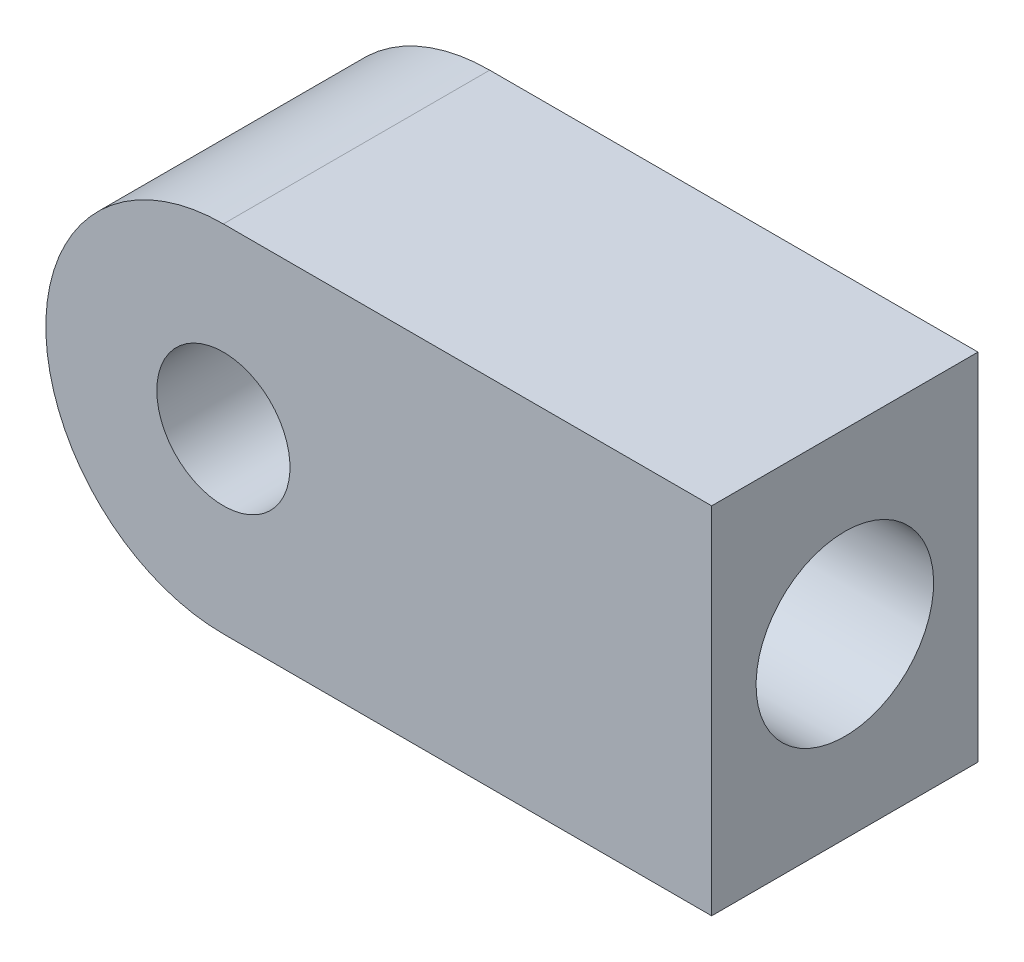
ISO-10303-21;
HEADER;
FILE_DESCRIPTION(('STEP AP214'),'2;1');
FILE_NAME('part.step','',(''),(''),'','','');
FILE_SCHEMA(('AUTOMOTIVE_DESIGN { 1 0 10303 214 1 1 1 1 }'));
ENDSEC;
DATA;
#1=APPLICATION_CONTEXT('core data for automotive mechanical design processes');
#2=APPLICATION_PROTOCOL_DEFINITION('international standard','automotive_design',2000,#1);
#3=PRODUCT_CONTEXT('',#1,'mechanical');
#4=PRODUCT('Part','Part','',(#3));
#5=PRODUCT_RELATED_PRODUCT_CATEGORY('part','',(#4));
#6=PRODUCT_DEFINITION_FORMATION('','',#4);
#7=PRODUCT_DEFINITION_CONTEXT('part definition',#1,'design');
#8=PRODUCT_DEFINITION('design','',#6,#7);
#9=PRODUCT_DEFINITION_SHAPE('','',#8);
#10=(LENGTH_UNIT() NAMED_UNIT(*) SI_UNIT(.MILLI.,.METRE.));
#11=(NAMED_UNIT(*) PLANE_ANGLE_UNIT() SI_UNIT($,.RADIAN.));
#12=(NAMED_UNIT(*) SI_UNIT($,.STERADIAN.) SOLID_ANGLE_UNIT());
#13=UNCERTAINTY_MEASURE_WITH_UNIT(LENGTH_MEASURE(1.E-05),#10,'distance_accuracy_value','');
#14=(GEOMETRIC_REPRESENTATION_CONTEXT(3) GLOBAL_UNCERTAINTY_ASSIGNED_CONTEXT((#13)) GLOBAL_UNIT_ASSIGNED_CONTEXT((#10,
#11,#12)) REPRESENTATION_CONTEXT('',''));
#15=CARTESIAN_POINT('',(0.,0.,0.));
#16=DIRECTION('',(0.,0.,1.));
#17=DIRECTION('',(1.,0.,0.));
#18=AXIS2_PLACEMENT_3D('',#15,#16,#17);
#19=CARTESIAN_POINT('',(-69.8500000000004,0.,19.0499999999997));
#20=DIRECTION('',(0.,0.,1.));
#21=DIRECTION('',(1.,0.,0.));
#22=AXIS2_PLACEMENT_3D('',#19,#20,#21);
#23=PLANE('',#22);
#24=CARTESIAN_POINT('',(-69.8500000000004,0.,19.0499999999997));
#25=DIRECTION('',(0.,0.,1.));
#26=DIRECTION('',(1.,0.,0.));
#27=AXIS2_PLACEMENT_3D('',#24,#25,#26);
#28=CIRCLE('',#27,25.4);
#29=CARTESIAN_POINT('',(-69.8500000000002,25.4,19.05));
#30=VERTEX_POINT('',#29);
#31=CARTESIAN_POINT('',(-69.8500000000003,-25.4,19.05));
#32=VERTEX_POINT('',#31);
#33=EDGE_CURVE('E104',#30,#32,#28,.T.);
#34=ORIENTED_EDGE('',*,*,#33,.T.);
#35=DIRECTION('',(1.,0.,0.));
#36=VECTOR('',#35,1.);
#37=CARTESIAN_POINT('',(-69.8500000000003,-25.4,19.05));
#38=LINE('',#37,#36);
#39=CARTESIAN_POINT('',(-4.44089209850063E-13,-25.4000000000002,19.0499999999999));
#40=VERTEX_POINT('',#39);
#41=EDGE_CURVE('E81',#32,#40,#38,.T.);
#42=ORIENTED_EDGE('',*,*,#41,.T.);
#43=DIRECTION('',(0.,-1.,0.));
#44=VECTOR('',#43,1.);
#45=CARTESIAN_POINT('',(-4.44089209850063E-13,25.3999999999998,19.05));
#46=LINE('',#45,#44);
#47=CARTESIAN_POINT('',(-4.44089209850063E-13,25.3999999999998,19.05));
#48=VERTEX_POINT('',#47);
#49=EDGE_CURVE('E101',#48,#40,#46,.T.);
#50=ORIENTED_EDGE('',*,*,#49,.F.);
#51=DIRECTION('',(1.,0.,0.));
#52=VECTOR('',#51,1.);
#53=CARTESIAN_POINT('',(-69.8500000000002,25.4,19.05));
#54=LINE('',#53,#52);
#55=EDGE_CURVE('E99',#30,#48,#54,.T.);
#56=ORIENTED_EDGE('',*,*,#55,.F.);
#57=EDGE_LOOP('',(#34,#42,#50,#56));
#58=FACE_BOUND('',#57,.T.);
#59=CARTESIAN_POINT('',(-69.8500000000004,0.,19.0499999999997));
#60=DIRECTION('',(0.,0.,1.));
#61=DIRECTION('',(1.,0.,0.));
#62=AXIS2_PLACEMENT_3D('',#59,#60,#61);
#63=CIRCLE('',#62,9.525);
#64=CARTESIAN_POINT('',(-79.3750000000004,0.,19.0499999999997));
#65=VERTEX_POINT('',#64);
#66=EDGE_CURVE('E89',#65,#65,#63,.T.);
#67=ORIENTED_EDGE('',*,*,#66,.F.);
#68=EDGE_LOOP('',(#67));
#69=FACE_BOUND('',#68,.T.);
#70=ADVANCED_FACE('F34',(#58,#69),#23,.T.);
#71=CARTESIAN_POINT('',(-69.8500000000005,-4.44089209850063E-13,-19.0500000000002));
#72=DIRECTION('',(0.,0.,1.));
#73=DIRECTION('',(1.,0.,0.));
#74=AXIS2_PLACEMENT_3D('',#71,#72,#73);
#75=PLANE('',#74);
#76=CARTESIAN_POINT('',(-69.8500000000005,-4.44089209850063E-13,-19.0500000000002));
#77=DIRECTION('',(0.,0.,1.));
#78=DIRECTION('',(1.,0.,0.));
#79=AXIS2_PLACEMENT_3D('',#76,#77,#78);
#80=CIRCLE('',#79,25.4);
#81=CARTESIAN_POINT('',(-69.8500000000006,25.4,-19.0500000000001));
#82=VERTEX_POINT('',#81);
#83=CARTESIAN_POINT('',(-69.8500000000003,-25.4000000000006,-19.05));
#84=VERTEX_POINT('',#83);
#85=EDGE_CURVE('E85',#82,#84,#80,.T.);
#86=ORIENTED_EDGE('',*,*,#85,.F.);
#87=DIRECTION('',(1.,0.,0.));
#88=VECTOR('',#87,1.);
#89=CARTESIAN_POINT('',(-69.8500000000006,25.4,-19.0500000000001));
#90=LINE('',#89,#88);
#91=CARTESIAN_POINT('',(-4.44089209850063E-13,25.3999999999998,-19.0500000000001));
#92=VERTEX_POINT('',#91);
#93=EDGE_CURVE('E95',#82,#92,#90,.T.);
#94=ORIENTED_EDGE('',*,*,#93,.T.);
#95=DIRECTION('',(0.,-1.,0.));
#96=VECTOR('',#95,1.);
#97=CARTESIAN_POINT('',(-4.44089209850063E-13,25.3999999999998,-19.0500000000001));
#98=LINE('',#97,#96);
#99=CARTESIAN_POINT('',(-1.11022302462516E-13,-25.4000000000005,-19.05));
#100=VERTEX_POINT('',#99);
#101=EDGE_CURVE('E93',#92,#100,#98,.T.);
#102=ORIENTED_EDGE('',*,*,#101,.T.);
#103=DIRECTION('',(1.,0.,0.));
#104=VECTOR('',#103,1.);
#105=CARTESIAN_POINT('',(-69.8500000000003,-25.4000000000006,-19.05));
#106=LINE('',#105,#104);
#107=EDGE_CURVE('E78',#84,#100,#106,.T.);
#108=ORIENTED_EDGE('',*,*,#107,.F.);
#109=EDGE_LOOP('',(#86,#94,#102,#108));
#110=FACE_BOUND('',#109,.T.);
#111=CARTESIAN_POINT('',(-69.8500000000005,-4.44089209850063E-13,-19.0500000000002));
#112=DIRECTION('',(0.,0.,1.));
#113=DIRECTION('',(1.,0.,0.));
#114=AXIS2_PLACEMENT_3D('',#111,#112,#113);
#115=CIRCLE('',#114,9.525);
#116=CARTESIAN_POINT('',(-79.3750000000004,0.,-19.0500000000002));
#117=VERTEX_POINT('',#116);
#118=EDGE_CURVE('E115',#117,#117,#115,.T.);
#119=ORIENTED_EDGE('',*,*,#118,.T.);
#120=EDGE_LOOP('',(#119));
#121=FACE_BOUND('',#120,.T.);
#122=ADVANCED_FACE('F91',(#110,#121),#75,.F.);
#123=CARTESIAN_POINT('',(-69.8500000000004,0.,19.0499999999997));
#124=DIRECTION('',(0.,0.,-1.));
#125=DIRECTION('',(-1.,0.,0.));
#126=AXIS2_PLACEMENT_3D('',#123,#124,#125);
#127=CYLINDRICAL_SURFACE('',#126,25.4);
#128=DIRECTION('',(0.,0.,-1.));
#129=VECTOR('',#128,1.);
#130=CARTESIAN_POINT('',(-69.8500000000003,-25.4,19.05));
#131=LINE('',#130,#129);
#132=EDGE_CURVE('E11',#32,#84,#131,.T.);
#133=ORIENTED_EDGE('',*,*,#132,.F.);
#134=ORIENTED_EDGE('',*,*,#33,.F.);
#135=DIRECTION('',(0.,0.,-1.));
#136=VECTOR('',#135,1.);
#137=CARTESIAN_POINT('',(-69.8500000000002,25.4,19.05));
#138=LINE('',#137,#136);
#139=EDGE_CURVE('E49',#30,#82,#138,.T.);
#140=ORIENTED_EDGE('',*,*,#139,.T.);
#141=ORIENTED_EDGE('',*,*,#85,.T.);
#142=EDGE_LOOP('',(#133,#134,#140,#141));
#143=FACE_BOUND('',#142,.T.);
#144=ADVANCED_FACE('F86',(#143),#127,.T.);
#145=CARTESIAN_POINT('',(-69.8500000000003,-25.4,19.05));
#146=DIRECTION('',(0.,1.,0.));
#147=DIRECTION('',(-1.,0.,0.));
#148=AXIS2_PLACEMENT_3D('',#145,#146,#147);
#149=PLANE('',#148);
#150=DIRECTION('',(0.,0.,-1.));
#151=VECTOR('',#150,1.);
#152=CARTESIAN_POINT('',(-4.44089209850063E-13,-25.4000000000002,19.0499999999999));
#153=LINE('',#152,#151);
#154=EDGE_CURVE('E42',#40,#100,#153,.T.);
#155=ORIENTED_EDGE('',*,*,#154,.F.);
#156=ORIENTED_EDGE('',*,*,#41,.F.);
#157=ORIENTED_EDGE('',*,*,#132,.T.);
#158=ORIENTED_EDGE('',*,*,#107,.T.);
#159=EDGE_LOOP('',(#155,#156,#157,#158));
#160=FACE_BOUND('',#159,.T.);
#161=ADVANCED_FACE('F36',(#160),#149,.F.);
#162=CARTESIAN_POINT('',(-4.44089209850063E-13,25.3999999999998,19.05));
#163=DIRECTION('',(1.,0.,0.));
#164=DIRECTION('',(0.,1.,0.));
#165=AXIS2_PLACEMENT_3D('',#162,#163,#164);
#166=PLANE('',#165);
#167=CARTESIAN_POINT('',(0.,0.,0.));
#168=DIRECTION('',(1.,0.,0.));
#169=DIRECTION('',(0.,1.,0.));
#170=AXIS2_PLACEMENT_3D('',#167,#168,#169);
#171=CIRCLE('',#170,12.7);
#172=CARTESIAN_POINT('',(0.,12.7000000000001,0.));
#173=VERTEX_POINT('',#172);
#174=EDGE_CURVE('E121',#173,#173,#171,.T.);
#175=ORIENTED_EDGE('',*,*,#174,.F.);
#176=EDGE_LOOP('',(#175));
#177=FACE_BOUND('',#176,.T.);
#178=DIRECTION('',(0.,0.,-1.));
#179=VECTOR('',#178,1.);
#180=CARTESIAN_POINT('',(-4.44089209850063E-13,25.3999999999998,19.05));
#181=LINE('',#180,#179);
#182=EDGE_CURVE('E57',#48,#92,#181,.T.);
#183=ORIENTED_EDGE('',*,*,#182,.F.);
#184=ORIENTED_EDGE('',*,*,#49,.T.);
#185=ORIENTED_EDGE('',*,*,#154,.T.);
#186=ORIENTED_EDGE('',*,*,#101,.F.);
#187=EDGE_LOOP('',(#183,#184,#185,#186));
#188=FACE_BOUND('',#187,.T.);
#189=ADVANCED_FACE('F107',(#177,#188),#166,.T.);
#190=CARTESIAN_POINT('',(-69.8500000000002,25.4,19.05));
#191=DIRECTION('',(0.,1.,0.));
#192=DIRECTION('',(-1.,0.,0.));
#193=AXIS2_PLACEMENT_3D('',#190,#191,#192);
#194=PLANE('',#193);
#195=ORIENTED_EDGE('',*,*,#55,.T.);
#196=ORIENTED_EDGE('',*,*,#182,.T.);
#197=ORIENTED_EDGE('',*,*,#93,.F.);
#198=ORIENTED_EDGE('',*,*,#139,.F.);
#199=EDGE_LOOP('',(#195,#196,#197,#198));
#200=FACE_BOUND('',#199,.T.);
#201=ADVANCED_FACE('F111',(#200),#194,.T.);
#202=CARTESIAN_POINT('',(-69.8500000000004,0.,19.0499999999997));
#203=DIRECTION('',(0.,0.,-1.));
#204=DIRECTION('',(-1.,0.,0.));
#205=AXIS2_PLACEMENT_3D('',#202,#203,#204);
#206=CYLINDRICAL_SURFACE('',#205,9.525);
#207=CARTESIAN_POINT('',(-79.3750000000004,0.,19.0499999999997));
#208=CARTESIAN_POINT('',(-79.3750000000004,0.,18.6531249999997));
#209=CARTESIAN_POINT('',(-79.3750000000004,0.,18.2562499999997));
#210=CARTESIAN_POINT('',(-79.3750000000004,0.,17.4624999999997));
#211=CARTESIAN_POINT('',(-79.3750000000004,0.,17.0656249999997));
#212=CARTESIAN_POINT('',(-79.3750000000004,0.,16.2718749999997));
#213=CARTESIAN_POINT('',(-79.3750000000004,0.,15.8749999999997));
#214=CARTESIAN_POINT('',(-79.3750000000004,0.,15.0812499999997));
#215=CARTESIAN_POINT('',(-79.3750000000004,0.,14.6843749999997));
#216=CARTESIAN_POINT('',(-79.3750000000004,0.,13.8906249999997));
#217=CARTESIAN_POINT('',(-79.3750000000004,0.,13.4937499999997));
#218=CARTESIAN_POINT('',(-79.3750000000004,0.,12.6999999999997));
#219=CARTESIAN_POINT('',(-79.3750000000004,0.,12.3031249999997));
#220=CARTESIAN_POINT('',(-79.3750000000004,0.,11.5093749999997));
#221=CARTESIAN_POINT('',(-79.3750000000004,0.,11.1124999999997));
#222=CARTESIAN_POINT('',(-79.3750000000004,0.,10.3187499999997));
#223=CARTESIAN_POINT('',(-79.3750000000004,0.,9.92187499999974));
#224=CARTESIAN_POINT('',(-79.3750000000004,0.,9.12812499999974));
#225=CARTESIAN_POINT('',(-79.3750000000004,0.,8.73124999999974));
#226=CARTESIAN_POINT('',(-79.3750000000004,0.,7.93749999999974));
#227=CARTESIAN_POINT('',(-79.3750000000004,0.,7.54062499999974));
#228=CARTESIAN_POINT('',(-79.3750000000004,0.,6.74687499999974));
#229=CARTESIAN_POINT('',(-79.3750000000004,0.,6.34999999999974));
#230=CARTESIAN_POINT('',(-79.3750000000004,0.,5.55624999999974));
#231=CARTESIAN_POINT('',(-79.3750000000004,0.,5.15937499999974));
#232=CARTESIAN_POINT('',(-79.3750000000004,0.,4.36562499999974));
#233=CARTESIAN_POINT('',(-79.3750000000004,0.,3.96874999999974));
#234=CARTESIAN_POINT('',(-79.3750000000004,0.,3.17499999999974));
#235=CARTESIAN_POINT('',(-79.3750000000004,0.,2.77812499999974));
#236=CARTESIAN_POINT('',(-79.3750000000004,0.,1.98437499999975));
#237=CARTESIAN_POINT('',(-79.3750000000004,0.,1.58749999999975));
#238=CARTESIAN_POINT('',(-79.3750000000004,0.,0.793749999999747));
#239=CARTESIAN_POINT('',(-79.3750000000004,0.,0.396874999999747));
#240=CARTESIAN_POINT('',(-79.3750000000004,0.,-0.396875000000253));
#241=CARTESIAN_POINT('',(-79.3750000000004,0.,-0.793750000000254));
#242=CARTESIAN_POINT('',(-79.3750000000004,0.,-1.58750000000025));
#243=CARTESIAN_POINT('',(-79.3750000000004,0.,-1.98437500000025));
#244=CARTESIAN_POINT('',(-79.3750000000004,0.,-2.77812500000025));
#245=CARTESIAN_POINT('',(-79.3750000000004,0.,-3.17500000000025));
#246=CARTESIAN_POINT('',(-79.3750000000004,0.,-3.96875000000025));
#247=CARTESIAN_POINT('',(-79.3750000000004,0.,-4.36562500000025));
#248=CARTESIAN_POINT('',(-79.3750000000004,0.,-5.15937500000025));
#249=CARTESIAN_POINT('',(-79.3750000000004,0.,-5.55625000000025));
#250=CARTESIAN_POINT('',(-79.3750000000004,0.,-6.35000000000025));
#251=CARTESIAN_POINT('',(-79.3750000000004,0.,-6.74687500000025));
#252=CARTESIAN_POINT('',(-79.3750000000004,0.,-7.54062500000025));
#253=CARTESIAN_POINT('',(-79.3750000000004,0.,-7.93750000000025));
#254=CARTESIAN_POINT('',(-79.3750000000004,0.,-8.73125000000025));
#255=CARTESIAN_POINT('',(-79.3750000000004,0.,-9.12812500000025));
#256=CARTESIAN_POINT('',(-79.3750000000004,0.,-9.92187500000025));
#257=CARTESIAN_POINT('',(-79.3750000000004,0.,-10.3187500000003));
#258=CARTESIAN_POINT('',(-79.3750000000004,0.,-11.1125000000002));
#259=CARTESIAN_POINT('',(-79.3750000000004,0.,-11.5093750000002));
#260=CARTESIAN_POINT('',(-79.3750000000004,0.,-12.3031250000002));
#261=CARTESIAN_POINT('',(-79.3750000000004,0.,-12.7000000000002));
#262=CARTESIAN_POINT('',(-79.3750000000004,0.,-13.4937500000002));
#263=CARTESIAN_POINT('',(-79.3750000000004,0.,-13.8906250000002));
#264=CARTESIAN_POINT('',(-79.3750000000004,0.,-14.6843750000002));
#265=CARTESIAN_POINT('',(-79.3750000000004,0.,-15.0812500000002));
#266=CARTESIAN_POINT('',(-79.3750000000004,0.,-15.8750000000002));
#267=CARTESIAN_POINT('',(-79.3750000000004,0.,-16.2718750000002));
#268=CARTESIAN_POINT('',(-79.3750000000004,0.,-17.0656250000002));
#269=CARTESIAN_POINT('',(-79.3750000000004,0.,-17.4625000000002));
#270=CARTESIAN_POINT('',(-79.3750000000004,0.,-18.2562500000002));
#271=CARTESIAN_POINT('',(-79.3750000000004,0.,-18.6531250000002));
#272=CARTESIAN_POINT('',(-79.3750000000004,0.,-19.0500000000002));
#273=B_SPLINE_CURVE_WITH_KNOTS('',3,(#207,#208,#209,#210,#211,#212,#213,#214,#215,#216,#217,
#218,#219,#220,#221,#222,#223,#224,#225,#226,#227,#228,#229,#230,#231,#232,#233,#234,#235,#236,
#237,#238,#239,#240,#241,#242,#243,#244,#245,#246,#247,#248,#249,#250,#251,#252,#253,#254,#255,
#256,#257,#258,#259,#260,#261,#262,#263,#264,#265,#266,#267,#268,#269,#270,#271,#272),
.UNSPECIFIED.,.F.,.F.,(4,2,2,2,2,2,2,2,2,2,2,2,2,2,2,2,2,2,2,2,2,2,2,2,2,2,2,2,2,2,2,2,4),(0.,
1.190625,2.38125,3.571875,4.7625,5.953125,7.14375,8.334375,9.525,10.715625,11.90625,13.096875,
14.2875,15.478125,16.66875,17.859375,19.05,20.240625,21.43125,22.621875,23.8125,25.003125,
26.19375,27.384375,28.575,29.765625,30.95625,32.146875,33.3375,34.528125,35.71875,36.909375,
38.1),.UNSPECIFIED.);
#274=EDGE_CURVE('BSEAM132',#65,#117,#273,.T.);
#275=ORIENTED_EDGE('',*,*,#66,.T.);
#276=ORIENTED_EDGE('',*,*,#118,.F.);
#277=ORIENTED_EDGE('',*,*,#274,.T.);
#278=ORIENTED_EDGE('',*,*,#274,.F.);
#279=EDGE_LOOP('',(#275,#277,#276,#278));
#280=FACE_BOUND('',#279,.T.);
#281=ADVANCED_FACE('F132',(#280),#206,.F.);
#282=CARTESIAN_POINT('',(-38.1000000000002,-1.66533453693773E-13,-2.77555756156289E-13));
#283=DIRECTION('',(1.,0.,0.));
#284=DIRECTION('',(0.,1.,0.));
#285=AXIS2_PLACEMENT_3D('',#282,#283,#284);
#286=CYLINDRICAL_SURFACE('',#285,12.7);
#287=CARTESIAN_POINT('',(-38.1000000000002,-1.66533453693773E-13,-2.77555756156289E-13));
#288=DIRECTION('',(1.,0.,0.));
#289=DIRECTION('',(0.,1.,0.));
#290=AXIS2_PLACEMENT_3D('',#287,#288,#289);
#291=CIRCLE('',#290,12.7);
#292=CARTESIAN_POINT('',(-38.1000000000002,12.6999999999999,-2.77555756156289E-13));
#293=VERTEX_POINT('',#292);
#294=EDGE_CURVE('E118',#293,#293,#291,.T.);
#295=ORIENTED_EDGE('',*,*,#294,.F.);
#296=EDGE_LOOP('',(#295));
#297=FACE_BOUND('',#296,.T.);
#298=ORIENTED_EDGE('',*,*,#174,.T.);
#299=EDGE_LOOP('',(#298));
#300=FACE_BOUND('',#299,.T.);
#301=ADVANCED_FACE('F125',(#297,#300),#286,.F.);
#302=CARTESIAN_POINT('',(-38.1000000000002,-1.66533453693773E-13,-2.77555756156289E-13));
#303=DIRECTION('',(1.,0.,0.));
#304=DIRECTION('',(0.,1.,0.));
#305=AXIS2_PLACEMENT_3D('',#302,#303,#304);
#306=PLANE('',#305);
#307=ORIENTED_EDGE('',*,*,#294,.T.);
#308=EDGE_LOOP('',(#307));
#309=FACE_BOUND('',#308,.T.);
#310=ADVANCED_FACE('F171',(#309),#306,.T.);
#311=CLOSED_SHELL('',(#70,#122,#144,#161,#189,#201,#281,#301,#310));
#312=MANIFOLD_SOLID_BREP('B2',#311);
#313=ADVANCED_BREP_SHAPE_REPRESENTATION('',(#18,#312),#14);
#314=SHAPE_DEFINITION_REPRESENTATION(#9,#313);
ENDSEC;
END-ISO-10303-21;
